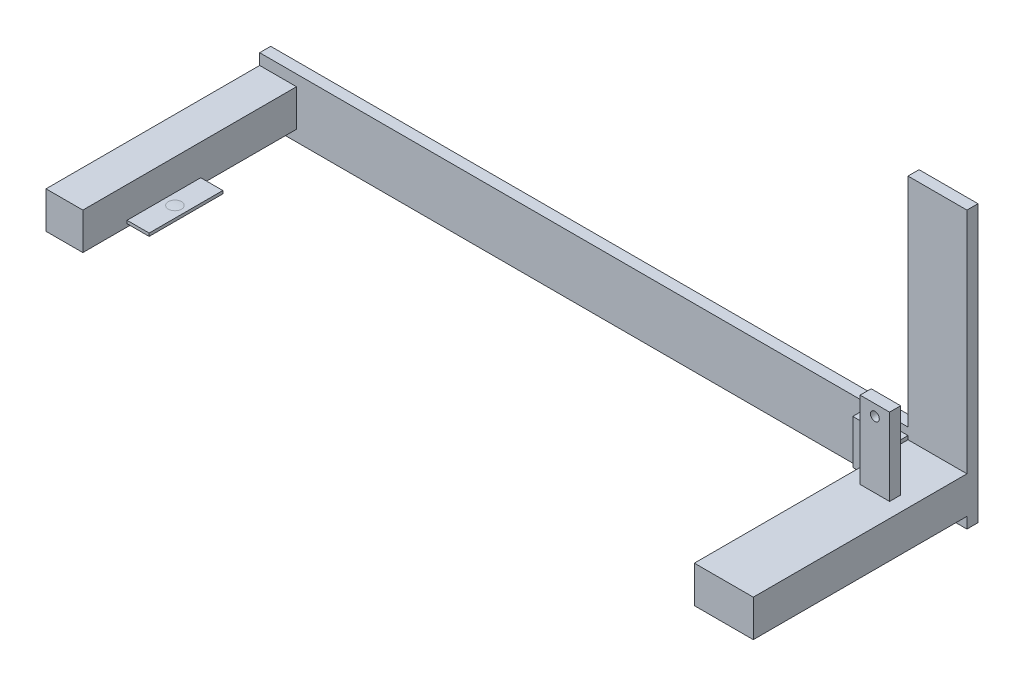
ISO-10303-21;
HEADER;
FILE_DESCRIPTION(('STEP AP214'),'2;1');
FILE_NAME('part.step','',(''),(''),'','','');
FILE_SCHEMA(('AUTOMOTIVE_DESIGN { 1 0 10303 214 1 1 1 1 }'));
ENDSEC;
DATA;
#1=APPLICATION_CONTEXT('core data for automotive mechanical design processes');
#2=APPLICATION_PROTOCOL_DEFINITION('international standard','automotive_design',2000,#1);
#3=PRODUCT_CONTEXT('',#1,'mechanical');
#4=PRODUCT('Part','Part','',(#3));
#5=PRODUCT_RELATED_PRODUCT_CATEGORY('part','',(#4));
#6=PRODUCT_DEFINITION_FORMATION('','',#4);
#7=PRODUCT_DEFINITION_CONTEXT('part definition',#1,'design');
#8=PRODUCT_DEFINITION('design','',#6,#7);
#9=PRODUCT_DEFINITION_SHAPE('','',#8);
#10=(LENGTH_UNIT() NAMED_UNIT(*) SI_UNIT(.MILLI.,.METRE.));
#11=(NAMED_UNIT(*) PLANE_ANGLE_UNIT() SI_UNIT($,.RADIAN.));
#12=(NAMED_UNIT(*) SI_UNIT($,.STERADIAN.) SOLID_ANGLE_UNIT());
#13=UNCERTAINTY_MEASURE_WITH_UNIT(LENGTH_MEASURE(1.E-05),#10,'distance_accuracy_value','');
#14=(GEOMETRIC_REPRESENTATION_CONTEXT(3) GLOBAL_UNCERTAINTY_ASSIGNED_CONTEXT((#13)) GLOBAL_UNIT_ASSIGNED_CONTEXT((#10,
#11,#12)) REPRESENTATION_CONTEXT('',''));
#15=CARTESIAN_POINT('',(0.,0.,0.));
#16=DIRECTION('',(0.,0.,1.));
#17=DIRECTION('',(1.,0.,0.));
#18=AXIS2_PLACEMENT_3D('',#15,#16,#17);
#19=CARTESIAN_POINT('',(-730.,-47.,245.));
#20=DIRECTION('',(0.,-1.,0.));
#21=DIRECTION('',(0.,0.,-1.));
#22=AXIS2_PLACEMENT_3D('',#19,#20,#21);
#23=PLANE('',#22);
#24=DIRECTION('',(0.,0.,1.));
#25=VECTOR('',#24,1.);
#26=CARTESIAN_POINT('',(-760.,-47.,245.));
#27=LINE('',#26,#25);
#28=CARTESIAN_POINT('',(-760.,-47.,145.));
#29=VERTEX_POINT('',#28);
#30=CARTESIAN_POINT('',(-760.,-47.,245.));
#31=VERTEX_POINT('',#30);
#32=EDGE_CURVE('E216',#29,#31,#27,.T.);
#33=ORIENTED_EDGE('',*,*,#32,.T.);
#34=DIRECTION('',(-1.,0.,0.));
#35=VECTOR('',#34,1.);
#36=CARTESIAN_POINT('',(-730.,-47.,245.));
#37=LINE('',#36,#35);
#38=CARTESIAN_POINT('',(-730.,-47.,245.));
#39=VERTEX_POINT('',#38);
#40=EDGE_CURVE('E227',#39,#31,#37,.T.);
#41=ORIENTED_EDGE('',*,*,#40,.F.);
#42=DIRECTION('',(0.,0.,1.));
#43=VECTOR('',#42,1.);
#44=CARTESIAN_POINT('',(-730.,-47.,245.));
#45=LINE('',#44,#43);
#46=CARTESIAN_POINT('',(-730.,-47.,145.));
#47=VERTEX_POINT('',#46);
#48=EDGE_CURVE('E236',#47,#39,#45,.T.);
#49=ORIENTED_EDGE('',*,*,#48,.F.);
#50=DIRECTION('',(-1.,0.,0.));
#51=VECTOR('',#50,1.);
#52=CARTESIAN_POINT('',(-730.,-47.,145.));
#53=LINE('',#52,#51);
#54=EDGE_CURVE('E230',#47,#29,#53,.T.);
#55=ORIENTED_EDGE('',*,*,#54,.T.);
#56=EDGE_LOOP('',(#33,#41,#49,#55));
#57=FACE_BOUND('',#56,.T.);
#58=CARTESIAN_POINT('',(-745.,-47.,195.));
#59=DIRECTION('',(0.,-1.,0.));
#60=DIRECTION('',(0.,0.,-1.));
#61=AXIS2_PLACEMENT_3D('',#58,#59,#60);
#62=CIRCLE('',#61,8.93532316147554);
#63=CARTESIAN_POINT('',(-745.,-47.,186.064676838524));
#64=VERTEX_POINT('',#63);
#65=EDGE_CURVE('E11',#64,#64,#62,.F.);
#66=ORIENTED_EDGE('',*,*,#65,.F.);
#67=EDGE_LOOP('',(#66));
#68=FACE_BOUND('',#67,.T.);
#69=ADVANCED_FACE('F38',(#57,#68),#23,.F.);
#70=CARTESIAN_POINT('',(70.,-4.99999999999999,305.));
#71=DIRECTION('',(1.,0.,0.));
#72=DIRECTION('',(0.,0.,-1.));
#73=AXIS2_PLACEMENT_3D('',#70,#71,#72);
#74=PLANE('',#73);
#75=DIRECTION('',(0.,1.,0.));
#76=VECTOR('',#75,1.);
#77=CARTESIAN_POINT('',(70.,0.,30.));
#78=LINE('',#77,#76);
#79=CARTESIAN_POINT('',(70.,-55.,30.));
#80=VERTEX_POINT('',#79);
#81=CARTESIAN_POINT('',(70.,-4.99999999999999,30.));
#82=VERTEX_POINT('',#81);
#83=EDGE_CURVE('E307',#80,#82,#78,.T.);
#84=ORIENTED_EDGE('',*,*,#83,.F.);
#85=DIRECTION('',(0.,0.,-1.));
#86=VECTOR('',#85,1.);
#87=CARTESIAN_POINT('',(70.,-55.,305.));
#88=LINE('',#87,#86);
#89=CARTESIAN_POINT('',(70.,-55.,305.));
#90=VERTEX_POINT('',#89);
#91=EDGE_CURVE('E345',#90,#80,#88,.T.);
#92=ORIENTED_EDGE('',*,*,#91,.F.);
#93=DIRECTION('',(0.,-1.,0.));
#94=VECTOR('',#93,1.);
#95=CARTESIAN_POINT('',(70.,-4.99999999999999,305.));
#96=LINE('',#95,#94);
#97=CARTESIAN_POINT('',(70.,-4.99999999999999,305.));
#98=VERTEX_POINT('',#97);
#99=EDGE_CURVE('E337',#98,#90,#96,.T.);
#100=ORIENTED_EDGE('',*,*,#99,.F.);
#101=DIRECTION('',(0.,0.,-1.));
#102=VECTOR('',#101,1.);
#103=CARTESIAN_POINT('',(70.,-4.99999999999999,305.));
#104=LINE('',#103,#102);
#105=EDGE_CURVE('E348',#98,#82,#104,.T.);
#106=ORIENTED_EDGE('',*,*,#105,.T.);
#107=EDGE_LOOP('',(#84,#92,#100,#106));
#108=FACE_BOUND('',#107,.T.);
#109=CARTESIAN_POINT('',(70.,-30.,277.5));
#110=DIRECTION('',(1.,0.,0.));
#111=DIRECTION('',(0.,0.,-1.));
#112=AXIS2_PLACEMENT_3D('',#109,#110,#111);
#113=CIRCLE('',#112,12.5);
#114=CARTESIAN_POINT('',(70.,-30.,265.));
#115=VERTEX_POINT('',#114);
#116=EDGE_CURVE('E46',#115,#115,#113,.F.);
#117=ORIENTED_EDGE('',*,*,#116,.F.);
#118=EDGE_LOOP('',(#117));
#119=FACE_BOUND('',#118,.T.);
#120=ADVANCED_FACE('F383',(#108,#119),#74,.F.);
#121=CARTESIAN_POINT('',(-760.,-5.,305.));
#122=DIRECTION('',(-1.,0.,0.));
#123=DIRECTION('',(0.,0.,1.));
#124=AXIS2_PLACEMENT_3D('',#121,#122,#123);
#125=PLANE('',#124);
#126=DIRECTION('',(0.,1.,0.));
#127=VECTOR('',#126,1.);
#128=CARTESIAN_POINT('',(-760.,-5.,15.));
#129=LINE('',#128,#127);
#130=CARTESIAN_POINT('',(-760.,-55.,15.));
#131=VERTEX_POINT('',#130);
#132=CARTESIAN_POINT('',(-760.,-5.,15.));
#133=VERTEX_POINT('',#132);
#134=EDGE_CURVE('E354',#131,#133,#129,.T.);
#135=ORIENTED_EDGE('',*,*,#134,.T.);
#136=DIRECTION('',(0.,0.,-1.));
#137=VECTOR('',#136,1.);
#138=CARTESIAN_POINT('',(-760.,-5.,305.));
#139=LINE('',#138,#137);
#140=CARTESIAN_POINT('',(-760.,-5.,305.));
#141=VERTEX_POINT('',#140);
#142=EDGE_CURVE('E371',#141,#133,#139,.T.);
#143=ORIENTED_EDGE('',*,*,#142,.F.);
#144=DIRECTION('',(0.,1.,0.));
#145=VECTOR('',#144,1.);
#146=CARTESIAN_POINT('',(-760.,-5.,305.));
#147=LINE('',#146,#145);
#148=CARTESIAN_POINT('',(-760.,-55.,305.));
#149=VERTEX_POINT('',#148);
#150=EDGE_CURVE('E526',#149,#141,#147,.T.);
#151=ORIENTED_EDGE('',*,*,#150,.F.);
#152=DIRECTION('',(0.,0.,-1.));
#153=VECTOR('',#152,1.);
#154=CARTESIAN_POINT('',(-760.,-55.,305.));
#155=LINE('',#154,#153);
#156=EDGE_CURVE('E519',#149,#131,#155,.T.);
#157=ORIENTED_EDGE('',*,*,#156,.T.);
#158=EDGE_LOOP('',(#135,#143,#151,#157));
#159=FACE_BOUND('',#158,.T.);
#160=DIRECTION('',(0.,-1.,0.));
#161=VECTOR('',#160,1.);
#162=CARTESIAN_POINT('',(-760.,-51.,245.));
#163=LINE('',#162,#161);
#164=CARTESIAN_POINT('',(-760.,-51.,245.));
#165=VERTEX_POINT('',#164);
#166=EDGE_CURVE('E213',#31,#165,#163,.T.);
#167=ORIENTED_EDGE('',*,*,#166,.F.);
#168=ORIENTED_EDGE('',*,*,#32,.F.);
#169=DIRECTION('',(0.,1.,0.));
#170=VECTOR('',#169,1.);
#171=CARTESIAN_POINT('',(-760.,-51.,145.));
#172=LINE('',#171,#170);
#173=CARTESIAN_POINT('',(-760.,-51.,145.));
#174=VERTEX_POINT('',#173);
#175=EDGE_CURVE('E58',#174,#29,#172,.T.);
#176=ORIENTED_EDGE('',*,*,#175,.F.);
#177=DIRECTION('',(0.,0.,-1.));
#178=VECTOR('',#177,1.);
#179=CARTESIAN_POINT('',(-760.,-51.,245.));
#180=LINE('',#179,#178);
#181=EDGE_CURVE('E53',#165,#174,#180,.T.);
#182=ORIENTED_EDGE('',*,*,#181,.F.);
#183=EDGE_LOOP('',(#167,#168,#176,#182));
#184=FACE_BOUND('',#183,.T.);
#185=ADVANCED_FACE('F215',(#159,#184),#125,.F.);
#186=CARTESIAN_POINT('',(150.,-4.99999999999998,305.));
#187=DIRECTION('',(0.,-1.,0.));
#188=DIRECTION('',(1.,0.,0.));
#189=AXIS2_PLACEMENT_3D('',#186,#187,#188);
#190=PLANE('',#189);
#191=DIRECTION('',(-1.,0.,0.));
#192=VECTOR('',#191,1.);
#193=CARTESIAN_POINT('',(150.,-4.99999999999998,15.));
#194=LINE('',#193,#192);
#195=CARTESIAN_POINT('',(150.,-4.99999999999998,15.));
#196=VERTEX_POINT('',#195);
#197=CARTESIAN_POINT('',(70.,-4.99999999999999,15.));
#198=VERTEX_POINT('',#197);
#199=EDGE_CURVE('E327',#196,#198,#194,.T.);
#200=ORIENTED_EDGE('',*,*,#199,.T.);
#201=DIRECTION('',(0.,0.,-1.));
#202=VECTOR('',#201,1.);
#203=CARTESIAN_POINT('',(70.,-4.99999999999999,305.));
#204=LINE('',#203,#202);
#205=EDGE_CURVE('E325',#82,#198,#204,.T.);
#206=ORIENTED_EDGE('',*,*,#205,.F.);
#207=ORIENTED_EDGE('',*,*,#105,.F.);
#208=DIRECTION('',(-1.,0.,0.));
#209=VECTOR('',#208,1.);
#210=CARTESIAN_POINT('',(150.,-4.99999999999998,305.));
#211=LINE('',#210,#209);
#212=CARTESIAN_POINT('',(150.,-4.99999999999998,305.));
#213=VERTEX_POINT('',#212);
#214=EDGE_CURVE('E335',#213,#98,#211,.T.);
#215=ORIENTED_EDGE('',*,*,#214,.F.);
#216=DIRECTION('',(0.,0.,-1.));
#217=VECTOR('',#216,1.);
#218=CARTESIAN_POINT('',(150.,-4.99999999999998,305.));
#219=LINE('',#218,#217);
#220=EDGE_CURVE('E351',#213,#196,#219,.T.);
#221=ORIENTED_EDGE('',*,*,#220,.T.);
#222=EDGE_LOOP('',(#200,#206,#207,#215,#221));
#223=FACE_BOUND('',#222,.T.);
#224=DIRECTION('',(0.,0.,-1.));
#225=VECTOR('',#224,1.);
#226=CARTESIAN_POINT('',(130.,-4.99999999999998,100.));
#227=LINE('',#226,#225);
#228=CARTESIAN_POINT('',(130.,-4.99999999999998,100.));
#229=VERTEX_POINT('',#228);
#230=CARTESIAN_POINT('',(130.,-4.99999999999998,85.));
#231=VERTEX_POINT('',#230);
#232=EDGE_CURVE('E257',#229,#231,#227,.T.);
#233=ORIENTED_EDGE('',*,*,#232,.F.);
#234=DIRECTION('',(1.,0.,0.));
#235=VECTOR('',#234,1.);
#236=CARTESIAN_POINT('',(130.,-4.99999999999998,100.));
#237=LINE('',#236,#235);
#238=CARTESIAN_POINT('',(90.0000000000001,-4.99999999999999,100.));
#239=VERTEX_POINT('',#238);
#240=EDGE_CURVE('E266',#239,#229,#237,.T.);
#241=ORIENTED_EDGE('',*,*,#240,.F.);
#242=DIRECTION('',(0.,0.,1.));
#243=VECTOR('',#242,1.);
#244=CARTESIAN_POINT('',(90.0000000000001,-4.99999999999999,100.));
#245=LINE('',#244,#243);
#246=CARTESIAN_POINT('',(90.,-4.99999999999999,85.));
#247=VERTEX_POINT('',#246);
#248=EDGE_CURVE('E263',#247,#239,#245,.T.);
#249=ORIENTED_EDGE('',*,*,#248,.F.);
#250=DIRECTION('',(-1.,0.,0.));
#251=VECTOR('',#250,1.);
#252=CARTESIAN_POINT('',(130.,-4.99999999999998,85.));
#253=LINE('',#252,#251);
#254=EDGE_CURVE('E260',#231,#247,#253,.T.);
#255=ORIENTED_EDGE('',*,*,#254,.F.);
#256=EDGE_LOOP('',(#233,#241,#249,#255));
#257=FACE_BOUND('',#256,.T.);
#258=ADVANCED_FACE('F391',(#223,#257),#190,.F.);
#259=CARTESIAN_POINT('',(-810.,-70.,15.));
#260=DIRECTION('',(0.,0.,1.));
#261=DIRECTION('',(1.,0.,0.));
#262=AXIS2_PLACEMENT_3D('',#259,#260,#261);
#263=PLANE('',#262);
#264=DIRECTION('',(-1.,0.,0.));
#265=VECTOR('',#264,1.);
#266=CARTESIAN_POINT('',(70.,0.,15.));
#267=LINE('',#266,#265);
#268=CARTESIAN_POINT('',(70.,0.,15.));
#269=VERTEX_POINT('',#268);
#270=CARTESIAN_POINT('',(10.,0.,15.));
#271=VERTEX_POINT('',#270);
#272=EDGE_CURVE('E296',#269,#271,#267,.T.);
#273=ORIENTED_EDGE('',*,*,#272,.F.);
#274=DIRECTION('',(0.,1.,0.));
#275=VECTOR('',#274,1.);
#276=CARTESIAN_POINT('',(70.,0.,15.));
#277=LINE('',#276,#275);
#278=EDGE_CURVE('E293',#198,#269,#277,.T.);
#279=ORIENTED_EDGE('',*,*,#278,.F.);
#280=ORIENTED_EDGE('',*,*,#199,.F.);
#281=DIRECTION('',(0.,1.,0.));
#282=VECTOR('',#281,1.);
#283=CARTESIAN_POINT('',(150.,305.,15.));
#284=LINE('',#283,#282);
#285=CARTESIAN_POINT('',(150.,305.,15.));
#286=VERTEX_POINT('',#285);
#287=EDGE_CURVE('E506',#196,#286,#284,.T.);
#288=ORIENTED_EDGE('',*,*,#287,.T.);
#289=DIRECTION('',(-1.,0.,0.));
#290=VECTOR('',#289,1.);
#291=CARTESIAN_POINT('',(70.,305.,15.));
#292=LINE('',#291,#290);
#293=CARTESIAN_POINT('',(70.,305.,15.));
#294=VERTEX_POINT('',#293);
#295=EDGE_CURVE('E505',#286,#294,#292,.T.);
#296=ORIENTED_EDGE('',*,*,#295,.T.);
#297=DIRECTION('',(0.,-1.,0.));
#298=VECTOR('',#297,1.);
#299=CARTESIAN_POINT('',(70.,10.,15.));
#300=LINE('',#299,#298);
#301=CARTESIAN_POINT('',(70.,10.,15.));
#302=VERTEX_POINT('',#301);
#303=EDGE_CURVE('E503',#294,#302,#300,.T.);
#304=ORIENTED_EDGE('',*,*,#303,.T.);
#305=DIRECTION('',(-1.,0.,0.));
#306=VECTOR('',#305,1.);
#307=CARTESIAN_POINT('',(-810.,9.99999999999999,15.));
#308=LINE('',#307,#306);
#309=CARTESIAN_POINT('',(-810.,9.99999999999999,15.));
#310=VERTEX_POINT('',#309);
#311=EDGE_CURVE('E501',#302,#310,#308,.T.);
#312=ORIENTED_EDGE('',*,*,#311,.T.);
#313=DIRECTION('',(0.,-1.,0.));
#314=VECTOR('',#313,1.);
#315=CARTESIAN_POINT('',(-810.,9.99999999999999,15.));
#316=LINE('',#315,#314);
#317=CARTESIAN_POINT('',(-810.,-5.,15.));
#318=VERTEX_POINT('',#317);
#319=EDGE_CURVE('E488',#310,#318,#316,.T.);
#320=ORIENTED_EDGE('',*,*,#319,.T.);
#321=DIRECTION('',(-1.,0.,0.));
#322=VECTOR('',#321,1.);
#323=CARTESIAN_POINT('',(-810.,-5.,15.));
#324=LINE('',#323,#322);
#325=EDGE_CURVE('E357',#133,#318,#324,.T.);
#326=ORIENTED_EDGE('',*,*,#325,.F.);
#327=ORIENTED_EDGE('',*,*,#134,.F.);
#328=DIRECTION('',(1.,0.,0.));
#329=VECTOR('',#328,1.);
#330=CARTESIAN_POINT('',(-810.,-55.,15.));
#331=LINE('',#330,#329);
#332=CARTESIAN_POINT('',(-810.,-55.,15.));
#333=VERTEX_POINT('',#332);
#334=EDGE_CURVE('E353',#333,#131,#331,.T.);
#335=ORIENTED_EDGE('',*,*,#334,.F.);
#336=CARTESIAN_POINT('',(-810.,-70.,15.));
#337=VERTEX_POINT('',#336);
#338=EDGE_CURVE('E479',#333,#337,#316,.T.);
#339=ORIENTED_EDGE('',*,*,#338,.T.);
#340=DIRECTION('',(1.,0.,0.));
#341=VECTOR('',#340,1.);
#342=CARTESIAN_POINT('',(-810.,-70.,15.));
#343=LINE('',#342,#341);
#344=CARTESIAN_POINT('',(150.,-70.,15.));
#345=VERTEX_POINT('',#344);
#346=EDGE_CURVE('E482',#337,#345,#343,.T.);
#347=ORIENTED_EDGE('',*,*,#346,.T.);
#348=CARTESIAN_POINT('',(150.,-55.,15.));
#349=VERTEX_POINT('',#348);
#350=EDGE_CURVE('E465',#345,#349,#284,.T.);
#351=ORIENTED_EDGE('',*,*,#350,.T.);
#352=DIRECTION('',(1.,0.,0.));
#353=VECTOR('',#352,1.);
#354=CARTESIAN_POINT('',(150.,-55.,15.));
#355=LINE('',#354,#353);
#356=CARTESIAN_POINT('',(70.0000000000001,-55.,15.));
#357=VERTEX_POINT('',#356);
#358=EDGE_CURVE('E330',#357,#349,#355,.T.);
#359=ORIENTED_EDGE('',*,*,#358,.F.);
#360=CARTESIAN_POINT('',(70.,-60.,15.));
#361=VERTEX_POINT('',#360);
#362=EDGE_CURVE('E294',#361,#357,#277,.T.);
#363=ORIENTED_EDGE('',*,*,#362,.F.);
#364=DIRECTION('',(1.,0.,0.));
#365=VECTOR('',#364,1.);
#366=CARTESIAN_POINT('',(70.,-60.,15.));
#367=LINE('',#366,#365);
#368=CARTESIAN_POINT('',(10.,-60.,15.));
#369=VERTEX_POINT('',#368);
#370=EDGE_CURVE('E300',#369,#361,#367,.T.);
#371=ORIENTED_EDGE('',*,*,#370,.F.);
#372=DIRECTION('',(0.,-1.,0.));
#373=VECTOR('',#372,1.);
#374=CARTESIAN_POINT('',(10.,0.,15.));
#375=LINE('',#374,#373);
#376=EDGE_CURVE('E298',#271,#369,#375,.T.);
#377=ORIENTED_EDGE('',*,*,#376,.F.);
#378=EDGE_LOOP('',(#273,#279,#280,#288,#296,#304,#312,#320,#326,#327,#335,#339,#347,#351,#359,
#363,#371,#377));
#379=FACE_BOUND('',#378,.T.);
#380=ADVANCED_FACE('F402',(#379),#263,.T.);
#381=CARTESIAN_POINT('',(-810.,9.99999999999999,15.));
#382=DIRECTION('',(1.,0.,0.));
#383=DIRECTION('',(0.,0.,-1.));
#384=AXIS2_PLACEMENT_3D('',#381,#382,#383);
#385=PLANE('',#384);
#386=DIRECTION('',(0.,-1.,0.));
#387=VECTOR('',#386,1.);
#388=CARTESIAN_POINT('',(-810.,9.99999999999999,0.));
#389=LINE('',#388,#387);
#390=CARTESIAN_POINT('',(-810.,9.99999999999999,0.));
#391=VERTEX_POINT('',#390);
#392=CARTESIAN_POINT('',(-810.,-70.,0.));
#393=VERTEX_POINT('',#392);
#394=EDGE_CURVE('E460',#391,#393,#389,.T.);
#395=ORIENTED_EDGE('',*,*,#394,.T.);
#396=DIRECTION('',(0.,0.,-1.));
#397=VECTOR('',#396,1.);
#398=CARTESIAN_POINT('',(-810.,-70.,15.));
#399=LINE('',#398,#397);
#400=EDGE_CURVE('E377',#337,#393,#399,.T.);
#401=ORIENTED_EDGE('',*,*,#400,.F.);
#402=ORIENTED_EDGE('',*,*,#338,.F.);
#403=DIRECTION('',(0.,0.,-1.));
#404=VECTOR('',#403,1.);
#405=CARTESIAN_POINT('',(-810.,-55.,305.));
#406=LINE('',#405,#404);
#407=CARTESIAN_POINT('',(-810.,-55.,305.));
#408=VERTEX_POINT('',#407);
#409=EDGE_CURVE('E518',#408,#333,#406,.T.);
#410=ORIENTED_EDGE('',*,*,#409,.F.);
#411=DIRECTION('',(0.,-1.,0.));
#412=VECTOR('',#411,1.);
#413=CARTESIAN_POINT('',(-810.,-5.,305.));
#414=LINE('',#413,#412);
#415=CARTESIAN_POINT('',(-810.,-5.,305.));
#416=VERTEX_POINT('',#415);
#417=EDGE_CURVE('E360',#416,#408,#414,.T.);
#418=ORIENTED_EDGE('',*,*,#417,.F.);
#419=DIRECTION('',(0.,0.,-1.));
#420=VECTOR('',#419,1.);
#421=CARTESIAN_POINT('',(-810.,-5.,305.));
#422=LINE('',#421,#420);
#423=EDGE_CURVE('E368',#416,#318,#422,.T.);
#424=ORIENTED_EDGE('',*,*,#423,.T.);
#425=ORIENTED_EDGE('',*,*,#319,.F.);
#426=DIRECTION('',(0.,0.,-1.));
#427=VECTOR('',#426,1.);
#428=CARTESIAN_POINT('',(-810.,9.99999999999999,15.));
#429=LINE('',#428,#427);
#430=EDGE_CURVE('E498',#310,#391,#429,.T.);
#431=ORIENTED_EDGE('',*,*,#430,.T.);
#432=EDGE_LOOP('',(#395,#401,#402,#410,#418,#424,#425,#431));
#433=FACE_BOUND('',#432,.T.);
#434=ADVANCED_FACE('F40',(#433),#385,.F.);
#435=CARTESIAN_POINT('',(-810.,-70.,15.));
#436=DIRECTION('',(0.,1.,0.));
#437=DIRECTION('',(0.,0.,1.));
#438=AXIS2_PLACEMENT_3D('',#435,#436,#437);
#439=PLANE('',#438);
#440=DIRECTION('',(1.,0.,0.));
#441=VECTOR('',#440,1.);
#442=CARTESIAN_POINT('',(-810.,-70.,0.));
#443=LINE('',#442,#441);
#444=CARTESIAN_POINT('',(150.,-70.,0.));
#445=VERTEX_POINT('',#444);
#446=EDGE_CURVE('E450',#393,#445,#443,.T.);
#447=ORIENTED_EDGE('',*,*,#446,.T.);
#448=DIRECTION('',(0.,0.,-1.));
#449=VECTOR('',#448,1.);
#450=CARTESIAN_POINT('',(150.,-70.,15.));
#451=LINE('',#450,#449);
#452=EDGE_CURVE('E453',#345,#445,#451,.T.);
#453=ORIENTED_EDGE('',*,*,#452,.F.);
#454=ORIENTED_EDGE('',*,*,#346,.F.);
#455=ORIENTED_EDGE('',*,*,#400,.T.);
#456=EDGE_LOOP('',(#447,#453,#454,#455));
#457=FACE_BOUND('',#456,.T.);
#458=ADVANCED_FACE('F440',(#457),#439,.F.);
#459=CARTESIAN_POINT('',(150.,305.,15.));
#460=DIRECTION('',(-1.,0.,0.));
#461=DIRECTION('',(0.,0.,1.));
#462=AXIS2_PLACEMENT_3D('',#459,#460,#461);
#463=PLANE('',#462);
#464=DIRECTION('',(0.,1.,0.));
#465=VECTOR('',#464,1.);
#466=CARTESIAN_POINT('',(150.,305.,0.));
#467=LINE('',#466,#465);
#468=CARTESIAN_POINT('',(150.,305.,0.));
#469=VERTEX_POINT('',#468);
#470=EDGE_CURVE('E459',#445,#469,#467,.T.);
#471=ORIENTED_EDGE('',*,*,#470,.T.);
#472=DIRECTION('',(0.,0.,-1.));
#473=VECTOR('',#472,1.);
#474=CARTESIAN_POINT('',(150.,305.,15.));
#475=LINE('',#474,#473);
#476=EDGE_CURVE('E466',#286,#469,#475,.T.);
#477=ORIENTED_EDGE('',*,*,#476,.F.);
#478=ORIENTED_EDGE('',*,*,#287,.F.);
#479=ORIENTED_EDGE('',*,*,#220,.F.);
#480=DIRECTION('',(0.,1.,0.));
#481=VECTOR('',#480,1.);
#482=CARTESIAN_POINT('',(150.,-4.99999999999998,305.));
#483=LINE('',#482,#481);
#484=CARTESIAN_POINT('',(150.,-55.,305.));
#485=VERTEX_POINT('',#484);
#486=EDGE_CURVE('E332',#485,#213,#483,.T.);
#487=ORIENTED_EDGE('',*,*,#486,.F.);
#488=DIRECTION('',(0.,0.,-1.));
#489=VECTOR('',#488,1.);
#490=CARTESIAN_POINT('',(150.,-55.,305.));
#491=LINE('',#490,#489);
#492=EDGE_CURVE('E341',#485,#349,#491,.T.);
#493=ORIENTED_EDGE('',*,*,#492,.T.);
#494=ORIENTED_EDGE('',*,*,#350,.F.);
#495=ORIENTED_EDGE('',*,*,#452,.T.);
#496=EDGE_LOOP('',(#471,#477,#478,#479,#487,#493,#494,#495));
#497=FACE_BOUND('',#496,.T.);
#498=ADVANCED_FACE('F437',(#497),#463,.F.);
#499=CARTESIAN_POINT('',(70.,305.,15.));
#500=DIRECTION('',(0.,-1.,0.));
#501=DIRECTION('',(0.,0.,-1.));
#502=AXIS2_PLACEMENT_3D('',#499,#500,#501);
#503=PLANE('',#502);
#504=DIRECTION('',(-1.,0.,0.));
#505=VECTOR('',#504,1.);
#506=CARTESIAN_POINT('',(70.,305.,0.));
#507=LINE('',#506,#505);
#508=CARTESIAN_POINT('',(70.,305.,0.));
#509=VERTEX_POINT('',#508);
#510=EDGE_CURVE('E470',#469,#509,#507,.T.);
#511=ORIENTED_EDGE('',*,*,#510,.T.);
#512=DIRECTION('',(0.,0.,-1.));
#513=VECTOR('',#512,1.);
#514=CARTESIAN_POINT('',(70.,305.,15.));
#515=LINE('',#514,#513);
#516=EDGE_CURVE('E492',#294,#509,#515,.T.);
#517=ORIENTED_EDGE('',*,*,#516,.F.);
#518=ORIENTED_EDGE('',*,*,#295,.F.);
#519=ORIENTED_EDGE('',*,*,#476,.T.);
#520=EDGE_LOOP('',(#511,#517,#518,#519));
#521=FACE_BOUND('',#520,.T.);
#522=ADVANCED_FACE('F433',(#521),#503,.F.);
#523=CARTESIAN_POINT('',(70.,10.,15.));
#524=DIRECTION('',(1.,0.,0.));
#525=DIRECTION('',(0.,1.,0.));
#526=AXIS2_PLACEMENT_3D('',#523,#524,#525);
#527=PLANE('',#526);
#528=DIRECTION('',(0.,-1.,0.));
#529=VECTOR('',#528,1.);
#530=CARTESIAN_POINT('',(70.,10.,0.));
#531=LINE('',#530,#529);
#532=CARTESIAN_POINT('',(70.,10.,0.));
#533=VERTEX_POINT('',#532);
#534=EDGE_CURVE('E472',#509,#533,#531,.T.);
#535=ORIENTED_EDGE('',*,*,#534,.T.);
#536=DIRECTION('',(0.,0.,-1.));
#537=VECTOR('',#536,1.);
#538=CARTESIAN_POINT('',(70.,10.,15.));
#539=LINE('',#538,#537);
#540=EDGE_CURVE('E495',#302,#533,#539,.T.);
#541=ORIENTED_EDGE('',*,*,#540,.F.);
#542=ORIENTED_EDGE('',*,*,#303,.F.);
#543=ORIENTED_EDGE('',*,*,#516,.T.);
#544=EDGE_LOOP('',(#535,#541,#542,#543));
#545=FACE_BOUND('',#544,.T.);
#546=ADVANCED_FACE('F429',(#545),#527,.F.);
#547=CARTESIAN_POINT('',(-810.,9.99999999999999,15.));
#548=DIRECTION('',(0.,-1.,0.));
#549=DIRECTION('',(1.,0.,0.));
#550=AXIS2_PLACEMENT_3D('',#547,#548,#549);
#551=PLANE('',#550);
#552=DIRECTION('',(-1.,0.,0.));
#553=VECTOR('',#552,1.);
#554=CARTESIAN_POINT('',(-810.,9.99999999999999,0.));
#555=LINE('',#554,#553);
#556=EDGE_CURVE('E477',#533,#391,#555,.T.);
#557=ORIENTED_EDGE('',*,*,#556,.T.);
#558=ORIENTED_EDGE('',*,*,#430,.F.);
#559=ORIENTED_EDGE('',*,*,#311,.F.);
#560=ORIENTED_EDGE('',*,*,#540,.T.);
#561=EDGE_LOOP('',(#557,#558,#559,#560));
#562=FACE_BOUND('',#561,.T.);
#563=ADVANCED_FACE('F419',(#562),#551,.F.);
#564=CARTESIAN_POINT('',(-810.,-70.,0.));
#565=DIRECTION('',(0.,0.,1.));
#566=DIRECTION('',(1.,0.,0.));
#567=AXIS2_PLACEMENT_3D('',#564,#565,#566);
#568=PLANE('',#567);
#569=ORIENTED_EDGE('',*,*,#394,.F.);
#570=ORIENTED_EDGE('',*,*,#556,.F.);
#571=ORIENTED_EDGE('',*,*,#534,.F.);
#572=ORIENTED_EDGE('',*,*,#510,.F.);
#573=ORIENTED_EDGE('',*,*,#470,.F.);
#574=ORIENTED_EDGE('',*,*,#446,.F.);
#575=EDGE_LOOP('',(#569,#570,#571,#572,#573,#574));
#576=FACE_BOUND('',#575,.T.);
#577=ADVANCED_FACE('F415',(#576),#568,.F.);
#578=CARTESIAN_POINT('',(-810.,-55.,305.));
#579=DIRECTION('',(0.,1.,0.));
#580=DIRECTION('',(0.,0.,1.));
#581=AXIS2_PLACEMENT_3D('',#578,#579,#580);
#582=PLANE('',#581);
#583=ORIENTED_EDGE('',*,*,#334,.T.);
#584=ORIENTED_EDGE('',*,*,#156,.F.);
#585=DIRECTION('',(1.,0.,0.));
#586=VECTOR('',#585,1.);
#587=CARTESIAN_POINT('',(-810.,-55.,305.));
#588=LINE('',#587,#586);
#589=EDGE_CURVE('E527',#408,#149,#588,.T.);
#590=ORIENTED_EDGE('',*,*,#589,.F.);
#591=ORIENTED_EDGE('',*,*,#409,.T.);
#592=EDGE_LOOP('',(#583,#584,#590,#591));
#593=FACE_BOUND('',#592,.T.);
#594=ADVANCED_FACE('F410',(#593),#582,.F.);
#595=CARTESIAN_POINT('',(-810.,-5.,305.));
#596=DIRECTION('',(0.,-1.,0.));
#597=DIRECTION('',(0.,0.,-1.));
#598=AXIS2_PLACEMENT_3D('',#595,#596,#597);
#599=PLANE('',#598);
#600=ORIENTED_EDGE('',*,*,#325,.T.);
#601=ORIENTED_EDGE('',*,*,#423,.F.);
#602=DIRECTION('',(-1.,0.,0.));
#603=VECTOR('',#602,1.);
#604=CARTESIAN_POINT('',(-810.,-5.,305.));
#605=LINE('',#604,#603);
#606=EDGE_CURVE('E372',#141,#416,#605,.T.);
#607=ORIENTED_EDGE('',*,*,#606,.F.);
#608=ORIENTED_EDGE('',*,*,#142,.T.);
#609=EDGE_LOOP('',(#600,#601,#607,#608));
#610=FACE_BOUND('',#609,.T.);
#611=ADVANCED_FACE('F407',(#610),#599,.F.);
#612=CARTESIAN_POINT('',(-810.,-55.,305.));
#613=DIRECTION('',(0.,0.,1.));
#614=DIRECTION('',(1.,0.,0.));
#615=AXIS2_PLACEMENT_3D('',#612,#613,#614);
#616=PLANE('',#615);
#617=ORIENTED_EDGE('',*,*,#417,.T.);
#618=ORIENTED_EDGE('',*,*,#589,.T.);
#619=ORIENTED_EDGE('',*,*,#150,.T.);
#620=ORIENTED_EDGE('',*,*,#606,.T.);
#621=EDGE_LOOP('',(#617,#618,#619,#620));
#622=FACE_BOUND('',#621,.T.);
#623=ADVANCED_FACE('F404',(#622),#616,.T.);
#624=CARTESIAN_POINT('',(150.,-55.,305.));
#625=DIRECTION('',(0.,1.,0.));
#626=DIRECTION('',(-1.,0.,0.));
#627=AXIS2_PLACEMENT_3D('',#624,#625,#626);
#628=PLANE('',#627);
#629=ORIENTED_EDGE('',*,*,#358,.T.);
#630=ORIENTED_EDGE('',*,*,#492,.F.);
#631=DIRECTION('',(1.,0.,0.));
#632=VECTOR('',#631,1.);
#633=CARTESIAN_POINT('',(150.,-55.,305.));
#634=LINE('',#633,#632);
#635=EDGE_CURVE('E339',#90,#485,#634,.T.);
#636=ORIENTED_EDGE('',*,*,#635,.F.);
#637=ORIENTED_EDGE('',*,*,#91,.T.);
#638=EDGE_CURVE('E344',#80,#357,#88,.T.);
#639=ORIENTED_EDGE('',*,*,#638,.T.);
#640=EDGE_LOOP('',(#629,#630,#636,#637,#639));
#641=FACE_BOUND('',#640,.T.);
#642=ADVANCED_FACE('F398',(#641),#628,.F.);
#643=CARTESIAN_POINT('',(150.,-55.,305.));
#644=DIRECTION('',(0.,0.,-1.));
#645=DIRECTION('',(-1.,0.,0.));
#646=AXIS2_PLACEMENT_3D('',#643,#644,#645);
#647=PLANE('',#646);
#648=ORIENTED_EDGE('',*,*,#486,.T.);
#649=ORIENTED_EDGE('',*,*,#214,.T.);
#650=ORIENTED_EDGE('',*,*,#99,.T.);
#651=ORIENTED_EDGE('',*,*,#635,.T.);
#652=EDGE_LOOP('',(#648,#649,#650,#651));
#653=FACE_BOUND('',#652,.T.);
#654=ADVANCED_FACE('F566',(#653),#647,.F.);
#655=CARTESIAN_POINT('',(70.,0.,30.));
#656=DIRECTION('',(-1.,0.,0.));
#657=DIRECTION('',(0.,0.,1.));
#658=AXIS2_PLACEMENT_3D('',#655,#656,#657);
#659=PLANE('',#658);
#660=CARTESIAN_POINT('',(70.,0.,30.));
#661=VERTEX_POINT('',#660);
#662=EDGE_CURVE('E302',#82,#661,#78,.T.);
#663=ORIENTED_EDGE('',*,*,#662,.F.);
#664=ORIENTED_EDGE('',*,*,#205,.T.);
#665=ORIENTED_EDGE('',*,*,#278,.T.);
#666=DIRECTION('',(0.,0.,-1.));
#667=VECTOR('',#666,1.);
#668=CARTESIAN_POINT('',(70.,0.,30.));
#669=LINE('',#668,#667);
#670=EDGE_CURVE('E322',#661,#269,#669,.T.);
#671=ORIENTED_EDGE('',*,*,#670,.F.);
#672=EDGE_LOOP('',(#663,#664,#665,#671));
#673=FACE_BOUND('',#672,.T.);
#674=ADVANCED_FACE('F550',(#673),#659,.F.);
#675=ORIENTED_EDGE('',*,*,#362,.T.);
#676=ORIENTED_EDGE('',*,*,#638,.F.);
#677=CARTESIAN_POINT('',(70.,-60.,30.));
#678=VERTEX_POINT('',#677);
#679=EDGE_CURVE('E303',#678,#80,#78,.T.);
#680=ORIENTED_EDGE('',*,*,#679,.F.);
#681=DIRECTION('',(0.,0.,-1.));
#682=VECTOR('',#681,1.);
#683=CARTESIAN_POINT('',(70.,-60.,30.));
#684=LINE('',#683,#682);
#685=EDGE_CURVE('E313',#678,#361,#684,.T.);
#686=ORIENTED_EDGE('',*,*,#685,.T.);
#687=EDGE_LOOP('',(#675,#676,#680,#686));
#688=FACE_BOUND('',#687,.T.);
#689=ADVANCED_FACE('F573',(#688),#659,.F.);
#690=CARTESIAN_POINT('',(70.,-60.,30.));
#691=DIRECTION('',(0.,0.,-1.));
#692=DIRECTION('',(-1.,0.,0.));
#693=AXIS2_PLACEMENT_3D('',#690,#691,#692);
#694=PLANE('',#693);
#695=ORIENTED_EDGE('',*,*,#679,.T.);
#696=ORIENTED_EDGE('',*,*,#83,.T.);
#697=ORIENTED_EDGE('',*,*,#662,.T.);
#698=DIRECTION('',(-1.,0.,0.));
#699=VECTOR('',#698,1.);
#700=CARTESIAN_POINT('',(70.,0.,30.));
#701=LINE('',#700,#699);
#702=CARTESIAN_POINT('',(10.,0.,30.));
#703=VERTEX_POINT('',#702);
#704=EDGE_CURVE('E306',#661,#703,#701,.T.);
#705=ORIENTED_EDGE('',*,*,#704,.T.);
#706=DIRECTION('',(0.,-1.,0.));
#707=VECTOR('',#706,1.);
#708=CARTESIAN_POINT('',(10.,0.,30.));
#709=LINE('',#708,#707);
#710=CARTESIAN_POINT('',(10.,-60.,30.));
#711=VERTEX_POINT('',#710);
#712=EDGE_CURVE('E309',#703,#711,#709,.T.);
#713=ORIENTED_EDGE('',*,*,#712,.T.);
#714=DIRECTION('',(1.,0.,0.));
#715=VECTOR('',#714,1.);
#716=CARTESIAN_POINT('',(70.,-60.,30.));
#717=LINE('',#716,#715);
#718=EDGE_CURVE('E311',#711,#678,#717,.T.);
#719=ORIENTED_EDGE('',*,*,#718,.T.);
#720=EDGE_LOOP('',(#695,#696,#697,#705,#713,#719));
#721=FACE_BOUND('',#720,.T.);
#722=CARTESIAN_POINT('',(40.,-30.,30.));
#723=DIRECTION('',(0.,0.,1.));
#724=DIRECTION('',(1.,0.,0.));
#725=AXIS2_PLACEMENT_3D('',#722,#723,#724);
#726=CIRCLE('',#725,10.);
#727=CARTESIAN_POINT('',(50.,-30.,30.));
#728=VERTEX_POINT('',#727);
#729=EDGE_CURVE('E290',#728,#728,#726,.T.);
#730=ORIENTED_EDGE('',*,*,#729,.F.);
#731=EDGE_LOOP('',(#730));
#732=FACE_BOUND('',#731,.T.);
#733=ADVANCED_FACE('F557',(#721,#732),#694,.F.);
#734=CARTESIAN_POINT('',(70.,0.,30.));
#735=DIRECTION('',(0.,-1.,0.));
#736=DIRECTION('',(0.,0.,-1.));
#737=AXIS2_PLACEMENT_3D('',#734,#735,#736);
#738=PLANE('',#737);
#739=ORIENTED_EDGE('',*,*,#272,.T.);
#740=DIRECTION('',(0.,0.,-1.));
#741=VECTOR('',#740,1.);
#742=CARTESIAN_POINT('',(10.,0.,30.));
#743=LINE('',#742,#741);
#744=EDGE_CURVE('E319',#703,#271,#743,.T.);
#745=ORIENTED_EDGE('',*,*,#744,.F.);
#746=ORIENTED_EDGE('',*,*,#704,.F.);
#747=ORIENTED_EDGE('',*,*,#670,.T.);
#748=EDGE_LOOP('',(#739,#745,#746,#747));
#749=FACE_BOUND('',#748,.T.);
#750=ADVANCED_FACE('F553',(#749),#738,.F.);
#751=CARTESIAN_POINT('',(10.,0.,30.));
#752=DIRECTION('',(1.,0.,0.));
#753=DIRECTION('',(0.,0.,-1.));
#754=AXIS2_PLACEMENT_3D('',#751,#752,#753);
#755=PLANE('',#754);
#756=ORIENTED_EDGE('',*,*,#376,.T.);
#757=DIRECTION('',(0.,0.,-1.));
#758=VECTOR('',#757,1.);
#759=CARTESIAN_POINT('',(10.,-60.,30.));
#760=LINE('',#759,#758);
#761=EDGE_CURVE('E316',#711,#369,#760,.T.);
#762=ORIENTED_EDGE('',*,*,#761,.F.);
#763=ORIENTED_EDGE('',*,*,#712,.F.);
#764=ORIENTED_EDGE('',*,*,#744,.T.);
#765=EDGE_LOOP('',(#756,#762,#763,#764));
#766=FACE_BOUND('',#765,.T.);
#767=ADVANCED_FACE('F579',(#766),#755,.F.);
#768=CARTESIAN_POINT('',(70.,-60.,30.));
#769=DIRECTION('',(0.,1.,0.));
#770=DIRECTION('',(0.,0.,1.));
#771=AXIS2_PLACEMENT_3D('',#768,#769,#770);
#772=PLANE('',#771);
#773=ORIENTED_EDGE('',*,*,#370,.T.);
#774=ORIENTED_EDGE('',*,*,#685,.F.);
#775=ORIENTED_EDGE('',*,*,#718,.F.);
#776=ORIENTED_EDGE('',*,*,#761,.T.);
#777=EDGE_LOOP('',(#773,#774,#775,#776));
#778=FACE_BOUND('',#777,.T.);
#779=ADVANCED_FACE('F577',(#778),#772,.F.);
#780=CARTESIAN_POINT('',(40.,-30.,30.));
#781=DIRECTION('',(0.,0.,-1.));
#782=DIRECTION('',(-1.,0.,0.));
#783=AXIS2_PLACEMENT_3D('',#780,#781,#782);
#784=CYLINDRICAL_SURFACE('',#783,10.);
#785=ORIENTED_EDGE('',*,*,#729,.T.);
#786=EDGE_LOOP('',(#785));
#787=FACE_BOUND('',#786,.T.);
#788=CARTESIAN_POINT('',(40.,-30.,15.));
#789=DIRECTION('',(0.,0.,1.));
#790=DIRECTION('',(1.,0.,0.));
#791=AXIS2_PLACEMENT_3D('',#788,#789,#790);
#792=CIRCLE('',#791,10.);
#793=CARTESIAN_POINT('',(50.,-30.,15.));
#794=VERTEX_POINT('',#793);
#795=EDGE_CURVE('E375',#794,#794,#792,.F.);
#796=ORIENTED_EDGE('',*,*,#795,.T.);
#797=EDGE_LOOP('',(#796));
#798=FACE_BOUND('',#797,.T.);
#799=ADVANCED_FACE('F425',(#787,#798),#784,.F.);
#800=ORIENTED_EDGE('',*,*,#795,.F.);
#801=EDGE_LOOP('',(#800));
#802=FACE_BOUND('',#801,.T.);
#803=ADVANCED_FACE('F421',(#802),#263,.T.);
#804=CARTESIAN_POINT('',(130.,100.,100.));
#805=DIRECTION('',(-1.,0.,0.));
#806=DIRECTION('',(0.,-1.,0.));
#807=AXIS2_PLACEMENT_3D('',#804,#805,#806);
#808=PLANE('',#807);
#809=ORIENTED_EDGE('',*,*,#232,.T.);
#810=DIRECTION('',(0.,-1.,0.));
#811=VECTOR('',#810,1.);
#812=CARTESIAN_POINT('',(130.,100.,85.));
#813=LINE('',#812,#811);
#814=CARTESIAN_POINT('',(130.,100.,85.));
#815=VERTEX_POINT('',#814);
#816=EDGE_CURVE('E287',#815,#231,#813,.T.);
#817=ORIENTED_EDGE('',*,*,#816,.F.);
#818=DIRECTION('',(0.,0.,-1.));
#819=VECTOR('',#818,1.);
#820=CARTESIAN_POINT('',(130.,100.,100.));
#821=LINE('',#820,#819);
#822=CARTESIAN_POINT('',(130.,100.,100.));
#823=VERTEX_POINT('',#822);
#824=EDGE_CURVE('E269',#823,#815,#821,.T.);
#825=ORIENTED_EDGE('',*,*,#824,.F.);
#826=DIRECTION('',(0.,-1.,0.));
#827=VECTOR('',#826,1.);
#828=CARTESIAN_POINT('',(130.,100.,100.));
#829=LINE('',#828,#827);
#830=EDGE_CURVE('E278',#823,#229,#829,.T.);
#831=ORIENTED_EDGE('',*,*,#830,.T.);
#832=EDGE_LOOP('',(#809,#817,#825,#831));
#833=FACE_BOUND('',#832,.T.);
#834=ADVANCED_FACE('F424',(#833),#808,.F.);
#835=CARTESIAN_POINT('',(130.,100.,85.));
#836=DIRECTION('',(0.,0.,1.));
#837=DIRECTION('',(1.,0.,0.));
#838=AXIS2_PLACEMENT_3D('',#835,#836,#837);
#839=PLANE('',#838);
#840=CARTESIAN_POINT('',(110.,85.,85.));
#841=DIRECTION('',(0.,0.,1.));
#842=DIRECTION('',(1.,0.,0.));
#843=AXIS2_PLACEMENT_3D('',#840,#841,#842);
#844=CIRCLE('',#843,6.00000000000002);
#845=CARTESIAN_POINT('',(116.,85.,85.));
#846=VERTEX_POINT('',#845);
#847=EDGE_CURVE('E251',#846,#846,#844,.F.);
#848=ORIENTED_EDGE('',*,*,#847,.F.);
#849=EDGE_LOOP('',(#848));
#850=FACE_BOUND('',#849,.T.);
#851=ORIENTED_EDGE('',*,*,#254,.T.);
#852=DIRECTION('',(0.,-1.,0.));
#853=VECTOR('',#852,1.);
#854=CARTESIAN_POINT('',(90.,100.,85.));
#855=LINE('',#854,#853);
#856=CARTESIAN_POINT('',(90.,100.,85.));
#857=VERTEX_POINT('',#856);
#858=EDGE_CURVE('E284',#857,#247,#855,.T.);
#859=ORIENTED_EDGE('',*,*,#858,.F.);
#860=DIRECTION('',(-1.,0.,0.));
#861=VECTOR('',#860,1.);
#862=CARTESIAN_POINT('',(130.,100.,85.));
#863=LINE('',#862,#861);
#864=EDGE_CURVE('E272',#815,#857,#863,.T.);
#865=ORIENTED_EDGE('',*,*,#864,.F.);
#866=ORIENTED_EDGE('',*,*,#816,.T.);
#867=EDGE_LOOP('',(#851,#859,#865,#866));
#868=FACE_BOUND('',#867,.T.);
#869=ADVANCED_FACE('F692',(#850,#868),#839,.F.);
#870=CARTESIAN_POINT('',(90.0000000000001,100.,100.));
#871=DIRECTION('',(1.,0.,0.));
#872=DIRECTION('',(0.,0.,-1.));
#873=AXIS2_PLACEMENT_3D('',#870,#871,#872);
#874=PLANE('',#873);
#875=ORIENTED_EDGE('',*,*,#248,.T.);
#876=DIRECTION('',(0.,-1.,0.));
#877=VECTOR('',#876,1.);
#878=CARTESIAN_POINT('',(90.0000000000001,100.,100.));
#879=LINE('',#878,#877);
#880=CARTESIAN_POINT('',(90.0000000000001,100.,100.));
#881=VERTEX_POINT('',#880);
#882=EDGE_CURVE('E281',#881,#239,#879,.T.);
#883=ORIENTED_EDGE('',*,*,#882,.F.);
#884=DIRECTION('',(0.,0.,1.));
#885=VECTOR('',#884,1.);
#886=CARTESIAN_POINT('',(90.0000000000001,100.,100.));
#887=LINE('',#886,#885);
#888=EDGE_CURVE('E274',#857,#881,#887,.T.);
#889=ORIENTED_EDGE('',*,*,#888,.F.);
#890=ORIENTED_EDGE('',*,*,#858,.T.);
#891=EDGE_LOOP('',(#875,#883,#889,#890));
#892=FACE_BOUND('',#891,.T.);
#893=ADVANCED_FACE('F700',(#892),#874,.F.);
#894=CARTESIAN_POINT('',(130.,100.,100.));
#895=DIRECTION('',(0.,0.,-1.));
#896=DIRECTION('',(-1.,0.,0.));
#897=AXIS2_PLACEMENT_3D('',#894,#895,#896);
#898=PLANE('',#897);
#899=CARTESIAN_POINT('',(110.,85.,100.));
#900=DIRECTION('',(0.,0.,1.));
#901=DIRECTION('',(1.,0.,0.));
#902=AXIS2_PLACEMENT_3D('',#899,#900,#901);
#903=CIRCLE('',#902,6.00000000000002);
#904=CARTESIAN_POINT('',(116.,85.,100.));
#905=VERTEX_POINT('',#904);
#906=EDGE_CURVE('E254',#905,#905,#903,.T.);
#907=ORIENTED_EDGE('',*,*,#906,.F.);
#908=EDGE_LOOP('',(#907));
#909=FACE_BOUND('',#908,.T.);
#910=ORIENTED_EDGE('',*,*,#240,.T.);
#911=ORIENTED_EDGE('',*,*,#830,.F.);
#912=DIRECTION('',(1.,0.,0.));
#913=VECTOR('',#912,1.);
#914=CARTESIAN_POINT('',(130.,100.,100.));
#915=LINE('',#914,#913);
#916=EDGE_CURVE('E276',#881,#823,#915,.T.);
#917=ORIENTED_EDGE('',*,*,#916,.F.);
#918=ORIENTED_EDGE('',*,*,#882,.T.);
#919=EDGE_LOOP('',(#910,#911,#917,#918));
#920=FACE_BOUND('',#919,.T.);
#921=ADVANCED_FACE('F705',(#909,#920),#898,.F.);
#922=CARTESIAN_POINT('',(130.,100.,85.));
#923=DIRECTION('',(0.,1.,0.));
#924=DIRECTION('',(-1.,0.,0.));
#925=AXIS2_PLACEMENT_3D('',#922,#923,#924);
#926=PLANE('',#925);
#927=ORIENTED_EDGE('',*,*,#824,.T.);
#928=ORIENTED_EDGE('',*,*,#864,.T.);
#929=ORIENTED_EDGE('',*,*,#888,.T.);
#930=ORIENTED_EDGE('',*,*,#916,.T.);
#931=EDGE_LOOP('',(#927,#928,#929,#930));
#932=FACE_BOUND('',#931,.T.);
#933=ADVANCED_FACE('F713',(#932),#926,.T.);
#934=CARTESIAN_POINT('',(110.,85.,-0.001000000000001));
#935=DIRECTION('',(0.,0.,1.));
#936=DIRECTION('',(1.,0.,0.));
#937=AXIS2_PLACEMENT_3D('',#934,#935,#936);
#938=CYLINDRICAL_SURFACE('',#937,6.00000000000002);
#939=CARTESIAN_POINT('',(116.,85.,100.));
#940=CARTESIAN_POINT('',(116.,85.,99.84375));
#941=CARTESIAN_POINT('',(116.,85.,99.6875));
#942=CARTESIAN_POINT('',(116.,85.,99.375));
#943=CARTESIAN_POINT('',(116.,85.,99.21875));
#944=CARTESIAN_POINT('',(116.,85.,98.90625));
#945=CARTESIAN_POINT('',(116.,85.,98.75));
#946=CARTESIAN_POINT('',(116.,85.,98.4375));
#947=CARTESIAN_POINT('',(116.,85.,98.28125));
#948=CARTESIAN_POINT('',(116.,85.,97.96875));
#949=CARTESIAN_POINT('',(116.,85.,97.8125));
#950=CARTESIAN_POINT('',(116.,85.,97.5));
#951=CARTESIAN_POINT('',(116.,85.,97.34375));
#952=CARTESIAN_POINT('',(116.,85.,97.03125));
#953=CARTESIAN_POINT('',(116.,85.,96.875));
#954=CARTESIAN_POINT('',(116.,85.,96.5625));
#955=CARTESIAN_POINT('',(116.,85.,96.40625));
#956=CARTESIAN_POINT('',(116.,85.,96.09375));
#957=CARTESIAN_POINT('',(116.,85.,95.9375));
#958=CARTESIAN_POINT('',(116.,85.,95.625));
#959=CARTESIAN_POINT('',(116.,85.,95.46875));
#960=CARTESIAN_POINT('',(116.,85.,95.15625));
#961=CARTESIAN_POINT('',(116.,85.,95.));
#962=CARTESIAN_POINT('',(116.,85.,94.6875));
#963=CARTESIAN_POINT('',(116.,85.,94.53125));
#964=CARTESIAN_POINT('',(116.,85.,94.21875));
#965=CARTESIAN_POINT('',(116.,85.,94.0625));
#966=CARTESIAN_POINT('',(116.,85.,93.75));
#967=CARTESIAN_POINT('',(116.,85.,93.59375));
#968=CARTESIAN_POINT('',(116.,85.,93.28125));
#969=CARTESIAN_POINT('',(116.,85.,93.125));
#970=CARTESIAN_POINT('',(116.,85.,92.8125));
#971=CARTESIAN_POINT('',(116.,85.,92.65625));
#972=CARTESIAN_POINT('',(116.,85.,92.34375));
#973=CARTESIAN_POINT('',(116.,85.,92.1875));
#974=CARTESIAN_POINT('',(116.,85.,91.875));
#975=CARTESIAN_POINT('',(116.,85.,91.71875));
#976=CARTESIAN_POINT('',(116.,85.,91.40625));
#977=CARTESIAN_POINT('',(116.,85.,91.25));
#978=CARTESIAN_POINT('',(116.,85.,90.9375));
#979=CARTESIAN_POINT('',(116.,85.,90.78125));
#980=CARTESIAN_POINT('',(116.,85.,90.46875));
#981=CARTESIAN_POINT('',(116.,85.,90.3125));
#982=CARTESIAN_POINT('',(116.,85.,90.));
#983=CARTESIAN_POINT('',(116.,85.,89.84375));
#984=CARTESIAN_POINT('',(116.,85.,89.53125));
#985=CARTESIAN_POINT('',(116.,85.,89.375));
#986=CARTESIAN_POINT('',(116.,85.,89.0625));
#987=CARTESIAN_POINT('',(116.,85.,88.90625));
#988=CARTESIAN_POINT('',(116.,85.,88.59375));
#989=CARTESIAN_POINT('',(116.,85.,88.4375));
#990=CARTESIAN_POINT('',(116.,85.,88.125));
#991=CARTESIAN_POINT('',(116.,85.,87.96875));
#992=CARTESIAN_POINT('',(116.,85.,87.65625));
#993=CARTESIAN_POINT('',(116.,85.,87.5));
#994=CARTESIAN_POINT('',(116.,85.,87.1875));
#995=CARTESIAN_POINT('',(116.,85.,87.03125));
#996=CARTESIAN_POINT('',(116.,85.,86.71875));
#997=CARTESIAN_POINT('',(116.,85.,86.5625));
#998=CARTESIAN_POINT('',(116.,85.,86.25));
#999=CARTESIAN_POINT('',(116.,85.,86.09375));
#1000=CARTESIAN_POINT('',(116.,85.,85.78125));
#1001=CARTESIAN_POINT('',(116.,85.,85.625));
#1002=CARTESIAN_POINT('',(116.,85.,85.3125));
#1003=CARTESIAN_POINT('',(116.,85.,85.15625));
#1004=CARTESIAN_POINT('',(116.,85.,85.));
#1005=B_SPLINE_CURVE_WITH_KNOTS('',3,(#939,#940,#941,#942,#943,#944,#945,#946,#947,#948,#949,
#950,#951,#952,#953,#954,#955,#956,#957,#958,#959,#960,#961,#962,#963,#964,#965,#966,#967,#968,
#969,#970,#971,#972,#973,#974,#975,#976,#977,#978,#979,#980,#981,#982,#983,#984,#985,#986,#987,
#988,#989,#990,#991,#992,#993,#994,#995,#996,#997,#998,#999,#1000,#1001,#1002,#1003,#1004),
.UNSPECIFIED.,.F.,.F.,(4,2,2,2,2,2,2,2,2,2,2,2,2,2,2,2,2,2,2,2,2,2,2,2,2,2,2,2,2,2,2,2,4),(0.,
0.468750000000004,0.937499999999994,1.40625,1.87499999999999,2.34374999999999,2.8125,
3.28124999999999,3.74999999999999,4.21874999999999,4.68749999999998,5.15624999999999,
5.62499999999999,6.09374999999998,6.56249999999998,7.03124999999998,7.49999999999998,
7.96874999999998,8.43749999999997,8.90624999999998,9.37499999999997,9.84374999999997,10.3125,
10.78125,11.25,11.71875,12.1875,12.65625,13.125,13.59375,14.0625,14.53125,15.),.UNSPECIFIED.);
#1006=EDGE_CURVE('BSEAM718',#905,#846,#1005,.T.);
#1007=ORIENTED_EDGE('',*,*,#906,.T.);
#1008=ORIENTED_EDGE('',*,*,#847,.T.);
#1009=ORIENTED_EDGE('',*,*,#1006,.T.);
#1010=ORIENTED_EDGE('',*,*,#1006,.F.);
#1011=EDGE_LOOP('',(#1007,#1009,#1008,#1010));
#1012=FACE_BOUND('',#1011,.T.);
#1013=ADVANCED_FACE('F718',(#1012),#938,.F.);
#1014=CARTESIAN_POINT('',(-730.,-51.,245.));
#1015=DIRECTION('',(0.,0.,-1.));
#1016=DIRECTION('',(-1.,0.,0.));
#1017=AXIS2_PLACEMENT_3D('',#1014,#1015,#1016);
#1018=PLANE('',#1017);
#1019=ORIENTED_EDGE('',*,*,#166,.T.);
#1020=DIRECTION('',(-1.,0.,0.));
#1021=VECTOR('',#1020,1.);
#1022=CARTESIAN_POINT('',(-730.,-51.,245.));
#1023=LINE('',#1022,#1021);
#1024=CARTESIAN_POINT('',(-730.,-51.,245.));
#1025=VERTEX_POINT('',#1024);
#1026=EDGE_CURVE('E249',#1025,#165,#1023,.T.);
#1027=ORIENTED_EDGE('',*,*,#1026,.F.);
#1028=DIRECTION('',(0.,-1.,0.));
#1029=VECTOR('',#1028,1.);
#1030=CARTESIAN_POINT('',(-730.,-51.,245.));
#1031=LINE('',#1030,#1029);
#1032=EDGE_CURVE('E231',#39,#1025,#1031,.T.);
#1033=ORIENTED_EDGE('',*,*,#1032,.F.);
#1034=ORIENTED_EDGE('',*,*,#40,.T.);
#1035=EDGE_LOOP('',(#1019,#1027,#1033,#1034));
#1036=FACE_BOUND('',#1035,.T.);
#1037=ADVANCED_FACE('F233',(#1036),#1018,.F.);
#1038=CARTESIAN_POINT('',(-730.,-51.,245.));
#1039=DIRECTION('',(0.,1.,0.));
#1040=DIRECTION('',(0.,0.,1.));
#1041=AXIS2_PLACEMENT_3D('',#1038,#1039,#1040);
#1042=PLANE('',#1041);
#1043=ORIENTED_EDGE('',*,*,#181,.T.);
#1044=DIRECTION('',(-1.,0.,0.));
#1045=VECTOR('',#1044,1.);
#1046=CARTESIAN_POINT('',(-730.,-51.,145.));
#1047=LINE('',#1046,#1045);
#1048=CARTESIAN_POINT('',(-730.,-51.,145.));
#1049=VERTEX_POINT('',#1048);
#1050=EDGE_CURVE('E241',#1049,#174,#1047,.T.);
#1051=ORIENTED_EDGE('',*,*,#1050,.F.);
#1052=DIRECTION('',(0.,0.,-1.));
#1053=VECTOR('',#1052,1.);
#1054=CARTESIAN_POINT('',(-730.,-51.,245.));
#1055=LINE('',#1054,#1053);
#1056=EDGE_CURVE('E912',#1025,#1049,#1055,.T.);
#1057=ORIENTED_EDGE('',*,*,#1056,.F.);
#1058=ORIENTED_EDGE('',*,*,#1026,.T.);
#1059=EDGE_LOOP('',(#1043,#1051,#1057,#1058));
#1060=FACE_BOUND('',#1059,.T.);
#1061=ADVANCED_FACE('F760',(#1060),#1042,.F.);
#1062=CARTESIAN_POINT('',(-730.,-51.,145.));
#1063=DIRECTION('',(0.,0.,1.));
#1064=DIRECTION('',(1.,0.,0.));
#1065=AXIS2_PLACEMENT_3D('',#1062,#1063,#1064);
#1066=PLANE('',#1065);
#1067=ORIENTED_EDGE('',*,*,#175,.T.);
#1068=ORIENTED_EDGE('',*,*,#54,.F.);
#1069=DIRECTION('',(0.,1.,0.));
#1070=VECTOR('',#1069,1.);
#1071=CARTESIAN_POINT('',(-730.,-51.,145.));
#1072=LINE('',#1071,#1070);
#1073=EDGE_CURVE('E243',#1049,#47,#1072,.T.);
#1074=ORIENTED_EDGE('',*,*,#1073,.F.);
#1075=ORIENTED_EDGE('',*,*,#1050,.T.);
#1076=EDGE_LOOP('',(#1067,#1068,#1074,#1075));
#1077=FACE_BOUND('',#1076,.T.);
#1078=ADVANCED_FACE('F769',(#1077),#1066,.F.);
#1079=CARTESIAN_POINT('',(-730.,-47.,245.));
#1080=DIRECTION('',(-1.,0.,0.));
#1081=DIRECTION('',(0.,0.,1.));
#1082=AXIS2_PLACEMENT_3D('',#1079,#1080,#1081);
#1083=PLANE('',#1082);
#1084=ORIENTED_EDGE('',*,*,#1032,.T.);
#1085=ORIENTED_EDGE('',*,*,#1056,.T.);
#1086=ORIENTED_EDGE('',*,*,#1073,.T.);
#1087=ORIENTED_EDGE('',*,*,#48,.T.);
#1088=EDGE_LOOP('',(#1084,#1085,#1086,#1087));
#1089=FACE_BOUND('',#1088,.T.);
#1090=ADVANCED_FACE('F779',(#1089),#1083,.F.);
#1091=CARTESIAN_POINT('',(65.,-30.,277.5));
#1092=DIRECTION('',(1.,0.,0.));
#1093=DIRECTION('',(0.,0.,-1.));
#1094=AXIS2_PLACEMENT_3D('',#1091,#1092,#1093);
#1095=CYLINDRICAL_SURFACE('',#1094,12.5);
#1096=CARTESIAN_POINT('',(65.,-30.,277.5));
#1097=DIRECTION('',(-1.,0.,0.));
#1098=DIRECTION('',(0.,0.,1.));
#1099=AXIS2_PLACEMENT_3D('',#1096,#1097,#1098);
#1100=CIRCLE('',#1099,12.5);
#1101=CARTESIAN_POINT('',(65.,-30.,290.));
#1102=VERTEX_POINT('',#1101);
#1103=EDGE_CURVE('E220',#1102,#1102,#1100,.T.);
#1104=ORIENTED_EDGE('',*,*,#1103,.F.);
#1105=EDGE_LOOP('',(#1104));
#1106=FACE_BOUND('',#1105,.T.);
#1107=ORIENTED_EDGE('',*,*,#116,.T.);
#1108=EDGE_LOOP('',(#1107));
#1109=FACE_BOUND('',#1108,.T.);
#1110=ADVANCED_FACE('F381',(#1106,#1109),#1095,.T.);
#1111=CARTESIAN_POINT('',(65.,-30.,277.5));
#1112=DIRECTION('',(-1.,0.,0.));
#1113=DIRECTION('',(0.,0.,1.));
#1114=AXIS2_PLACEMENT_3D('',#1111,#1112,#1113);
#1115=PLANE('',#1114);
#1116=CARTESIAN_POINT('',(65.,-30.,277.5));
#1117=DIRECTION('',(-1.,0.,0.));
#1118=DIRECTION('',(0.,0.,1.));
#1119=AXIS2_PLACEMENT_3D('',#1116,#1117,#1118);
#1120=CIRCLE('',#1119,5.99999999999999);
#1121=CARTESIAN_POINT('',(65.,-30.,283.5));
#1122=VERTEX_POINT('',#1121);
#1123=EDGE_CURVE('E902',#1122,#1122,#1120,.T.);
#1124=ORIENTED_EDGE('',*,*,#1123,.F.);
#1125=EDGE_LOOP('',(#1124));
#1126=FACE_BOUND('',#1125,.T.);
#1127=ORIENTED_EDGE('',*,*,#1103,.T.);
#1128=EDGE_LOOP('',(#1127));
#1129=FACE_BOUND('',#1128,.T.);
#1130=ADVANCED_FACE('F802',(#1126,#1129),#1115,.T.);
#1131=CARTESIAN_POINT('',(95.,-30.,277.5));
#1132=DIRECTION('',(-1.,0.,0.));
#1133=DIRECTION('',(0.,0.,1.));
#1134=AXIS2_PLACEMENT_3D('',#1131,#1132,#1133);
#1135=CYLINDRICAL_SURFACE('',#1134,5.99999999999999);
#1136=CARTESIAN_POINT('',(95.,-30.,277.5));
#1137=DIRECTION('',(-1.,0.,0.));
#1138=DIRECTION('',(0.,0.,1.));
#1139=AXIS2_PLACEMENT_3D('',#1136,#1137,#1138);
#1140=CIRCLE('',#1139,5.99999999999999);
#1141=CARTESIAN_POINT('',(95.,-30.,283.5));
#1142=VERTEX_POINT('',#1141);
#1143=EDGE_CURVE('E901',#1142,#1142,#1140,.T.);
#1144=ORIENTED_EDGE('',*,*,#1143,.F.);
#1145=EDGE_LOOP('',(#1144));
#1146=FACE_BOUND('',#1145,.T.);
#1147=ORIENTED_EDGE('',*,*,#1123,.T.);
#1148=EDGE_LOOP('',(#1147));
#1149=FACE_BOUND('',#1148,.T.);
#1150=ADVANCED_FACE('F812',(#1146,#1149),#1135,.F.);
#1151=CARTESIAN_POINT('',(95.,-30.,277.5));
#1152=DIRECTION('',(-1.,0.,0.));
#1153=DIRECTION('',(0.,0.,1.));
#1154=AXIS2_PLACEMENT_3D('',#1151,#1152,#1153);
#1155=PLANE('',#1154);
#1156=ORIENTED_EDGE('',*,*,#1143,.T.);
#1157=EDGE_LOOP('',(#1156));
#1158=FACE_BOUND('',#1157,.T.);
#1159=ADVANCED_FACE('F822',(#1158),#1155,.T.);
#1160=CARTESIAN_POINT('',(-745.,-146.6,195.));
#1161=DIRECTION('',(0.,1.,0.));
#1162=DIRECTION('',(0.,0.,-1.));
#1163=AXIS2_PLACEMENT_3D('',#1160,#1161,#1162);
#1164=SPHERICAL_SURFACE('',#1163,100.);
#1165=ORIENTED_EDGE('',*,*,#65,.T.);
#1166=EDGE_LOOP('',(#1165));
#1167=FACE_BOUND('',#1166,.T.);
#1168=ADVANCED_FACE('F832',(#1167),#1164,.T.);
#1169=CLOSED_SHELL('',(#69,#120,#185,#258,#380,#434,#458,#498,#522,#546,#563,#577,#594,#611,
#623,#642,#654,#674,#689,#733,#750,#767,#779,#799,#803,#834,#869,#893,#921,#933,#1013,#1037,
#1061,#1078,#1090,#1110,#1130,#1150,#1159,#1168));
#1170=MANIFOLD_SOLID_BREP('B2',#1169);
#1171=ADVANCED_BREP_SHAPE_REPRESENTATION('',(#18,#1170),#14);
#1172=SHAPE_DEFINITION_REPRESENTATION(#9,#1171);
ENDSEC;
END-ISO-10303-21;
